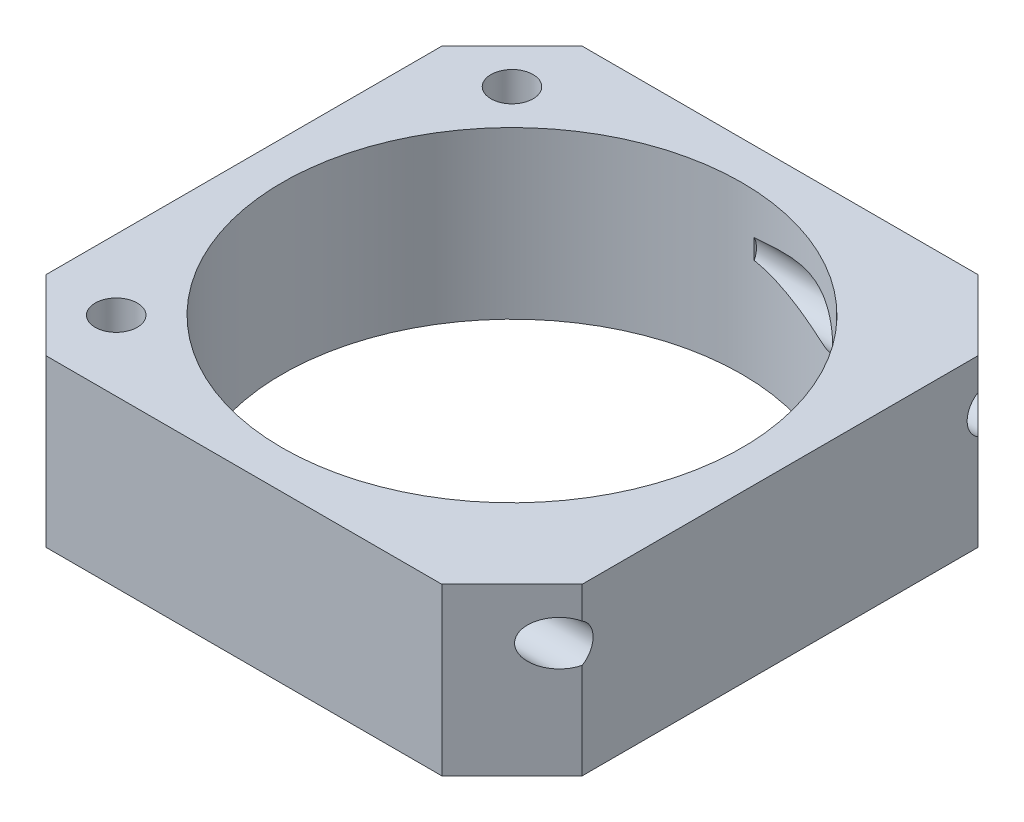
ISO-10303-21;
HEADER;
FILE_DESCRIPTION(('STEP AP214'),'2;1');
FILE_NAME('part.step','',(''),(''),'','','');
FILE_SCHEMA(('AUTOMOTIVE_DESIGN { 1 0 10303 214 1 1 1 1 }'));
ENDSEC;
DATA;
#1=APPLICATION_CONTEXT('core data for automotive mechanical design processes');
#2=APPLICATION_PROTOCOL_DEFINITION('international standard','automotive_design',2000,#1);
#3=PRODUCT_CONTEXT('',#1,'mechanical');
#4=PRODUCT('Part','Part','',(#3));
#5=PRODUCT_RELATED_PRODUCT_CATEGORY('part','',(#4));
#6=PRODUCT_DEFINITION_FORMATION('','',#4);
#7=PRODUCT_DEFINITION_CONTEXT('part definition',#1,'design');
#8=PRODUCT_DEFINITION('design','',#6,#7);
#9=PRODUCT_DEFINITION_SHAPE('','',#8);
#10=(LENGTH_UNIT() NAMED_UNIT(*) SI_UNIT(.MILLI.,.METRE.));
#11=(NAMED_UNIT(*) PLANE_ANGLE_UNIT() SI_UNIT($,.RADIAN.));
#12=(NAMED_UNIT(*) SI_UNIT($,.STERADIAN.) SOLID_ANGLE_UNIT());
#13=UNCERTAINTY_MEASURE_WITH_UNIT(LENGTH_MEASURE(1.E-05),#10,'distance_accuracy_value','');
#14=(GEOMETRIC_REPRESENTATION_CONTEXT(3) GLOBAL_UNCERTAINTY_ASSIGNED_CONTEXT((#13)) GLOBAL_UNIT_ASSIGNED_CONTEXT((#10,
#11,#12)) REPRESENTATION_CONTEXT('',''));
#15=CARTESIAN_POINT('',(0.,0.,0.));
#16=DIRECTION('',(0.,0.,1.));
#17=DIRECTION('',(1.,0.,0.));
#18=AXIS2_PLACEMENT_3D('',#15,#16,#17);
#19=CARTESIAN_POINT('',(0.,13.,0.));
#20=DIRECTION('',(0.,-1.,0.));
#21=DIRECTION('',(0.,0.,-1.));
#22=AXIS2_PLACEMENT_3D('',#19,#20,#21);
#23=PLANE('',#22);
#24=DIRECTION('',(1.,0.,0.));
#25=VECTOR('',#24,1.);
#26=CARTESIAN_POINT('',(0.,13.,0.));
#27=LINE('',#26,#25);
#28=CARTESIAN_POINT('',(5.5,13.,0.));
#29=VERTEX_POINT('',#28);
#30=CARTESIAN_POINT('',(36.5,13.,0.));
#31=VERTEX_POINT('',#30);
#32=EDGE_CURVE('E271',#29,#31,#27,.T.);
#33=ORIENTED_EDGE('',*,*,#32,.T.);
#34=DIRECTION('',(-0.707106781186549,0.,0.707106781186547));
#35=VECTOR('',#34,1.);
#36=CARTESIAN_POINT('',(42.,13.,-5.5));
#37=LINE('',#36,#35);
#38=CARTESIAN_POINT('',(42.,13.,-5.5));
#39=VERTEX_POINT('',#38);
#40=EDGE_CURVE('E163',#31,#39,#37,.F.);
#41=ORIENTED_EDGE('',*,*,#40,.T.);
#42=DIRECTION('',(0.,0.,-1.));
#43=VECTOR('',#42,1.);
#44=CARTESIAN_POINT('',(42.,13.,0.));
#45=LINE('',#44,#43);
#46=CARTESIAN_POINT('',(42.,13.,-36.5));
#47=VERTEX_POINT('',#46);
#48=EDGE_CURVE('E277',#39,#47,#45,.T.);
#49=ORIENTED_EDGE('',*,*,#48,.T.);
#50=DIRECTION('',(0.707106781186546,0.,0.707106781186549));
#51=VECTOR('',#50,1.);
#52=CARTESIAN_POINT('',(36.5,13.,-42.));
#53=LINE('',#52,#51);
#54=CARTESIAN_POINT('',(36.5,13.,-42.));
#55=VERTEX_POINT('',#54);
#56=EDGE_CURVE('E161',#47,#55,#53,.F.);
#57=ORIENTED_EDGE('',*,*,#56,.T.);
#58=DIRECTION('',(-1.,0.,0.));
#59=VECTOR('',#58,1.);
#60=CARTESIAN_POINT('',(0.,13.,-42.));
#61=LINE('',#60,#59);
#62=CARTESIAN_POINT('',(5.50000000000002,13.,-42.));
#63=VERTEX_POINT('',#62);
#64=EDGE_CURVE('E280',#55,#63,#61,.T.);
#65=ORIENTED_EDGE('',*,*,#64,.T.);
#66=DIRECTION('',(0.707106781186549,0.,-0.707106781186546));
#67=VECTOR('',#66,1.);
#68=CARTESIAN_POINT('',(0.,13.,-36.5));
#69=LINE('',#68,#67);
#70=CARTESIAN_POINT('',(0.,13.,-36.5));
#71=VERTEX_POINT('',#70);
#72=EDGE_CURVE('E157',#63,#71,#69,.F.);
#73=ORIENTED_EDGE('',*,*,#72,.T.);
#74=DIRECTION('',(0.,0.,1.));
#75=VECTOR('',#74,1.);
#76=CARTESIAN_POINT('',(0.,13.,0.));
#77=LINE('',#76,#75);
#78=CARTESIAN_POINT('',(0.,13.,-5.50000000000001));
#79=VERTEX_POINT('',#78);
#80=EDGE_CURVE('E274',#71,#79,#77,.T.);
#81=ORIENTED_EDGE('',*,*,#80,.T.);
#82=DIRECTION('',(-0.707106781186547,0.,-0.707106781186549));
#83=VECTOR('',#82,1.);
#84=CARTESIAN_POINT('',(5.5,13.,0.));
#85=LINE('',#84,#83);
#86=EDGE_CURVE('E159',#79,#29,#85,.F.);
#87=ORIENTED_EDGE('',*,*,#86,.T.);
#88=EDGE_LOOP('',(#33,#41,#49,#57,#65,#73,#81,#87));
#89=FACE_BOUND('',#88,.T.);
#90=CARTESIAN_POINT('',(5.5,13.,-36.5));
#91=DIRECTION('',(0.,1.,0.));
#92=DIRECTION('',(0.,0.,1.));
#93=AXIS2_PLACEMENT_3D('',#90,#91,#92);
#94=CIRCLE('',#93,1.65);
#95=CARTESIAN_POINT('',(5.5,13.,-38.15));
#96=VERTEX_POINT('',#95);
#97=EDGE_CURVE('E292',#96,#96,#94,.T.);
#98=ORIENTED_EDGE('',*,*,#97,.F.);
#99=EDGE_LOOP('',(#98));
#100=FACE_BOUND('',#99,.T.);
#101=CARTESIAN_POINT('',(21.0000000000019,13.,-21.0000000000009));
#102=DIRECTION('',(0.,1.,0.));
#103=DIRECTION('',(0.,0.,1.));
#104=AXIS2_PLACEMENT_3D('',#101,#102,#103);
#105=CIRCLE('',#104,18.);
#106=CARTESIAN_POINT('',(21.0000000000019,13.,-3.00000000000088));
#107=VERTEX_POINT('',#106);
#108=EDGE_CURVE('E318',#107,#107,#105,.T.);
#109=ORIENTED_EDGE('',*,*,#108,.F.);
#110=EDGE_LOOP('',(#109));
#111=FACE_BOUND('',#110,.T.);
#112=CARTESIAN_POINT('',(5.5,13.,-5.5));
#113=DIRECTION('',(0.,1.,0.));
#114=DIRECTION('',(0.,0.,1.));
#115=AXIS2_PLACEMENT_3D('',#112,#113,#114);
#116=CIRCLE('',#115,1.65);
#117=CARTESIAN_POINT('',(5.5,13.,-7.15));
#118=VERTEX_POINT('',#117);
#119=EDGE_CURVE('E210',#118,#118,#116,.T.);
#120=ORIENTED_EDGE('',*,*,#119,.F.);
#121=EDGE_LOOP('',(#120));
#122=FACE_BOUND('',#121,.T.);
#123=ADVANCED_FACE('F34',(#89,#100,#111,#122),#23,.F.);
#124=CARTESIAN_POINT('',(0.,0.,0.));
#125=DIRECTION('',(0.,-1.,0.));
#126=DIRECTION('',(0.,0.,-1.));
#127=AXIS2_PLACEMENT_3D('',#124,#125,#126);
#128=PLANE('',#127);
#129=CARTESIAN_POINT('',(21.0000000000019,0.,-21.0000000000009));
#130=DIRECTION('',(0.,1.,0.));
#131=DIRECTION('',(0.,0.,1.));
#132=AXIS2_PLACEMENT_3D('',#129,#130,#131);
#133=CIRCLE('',#132,18.);
#134=CARTESIAN_POINT('',(21.0000000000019,0.,-3.00000000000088));
#135=VERTEX_POINT('',#134);
#136=EDGE_CURVE('E316',#135,#135,#133,.T.);
#137=ORIENTED_EDGE('',*,*,#136,.T.);
#138=EDGE_LOOP('',(#137));
#139=FACE_BOUND('',#138,.T.);
#140=DIRECTION('',(0.,0.,-1.));
#141=VECTOR('',#140,1.);
#142=CARTESIAN_POINT('',(42.,0.,0.));
#143=LINE('',#142,#141);
#144=CARTESIAN_POINT('',(42.,0.,-5.5));
#145=VERTEX_POINT('',#144);
#146=CARTESIAN_POINT('',(42.,0.,-36.5));
#147=VERTEX_POINT('',#146);
#148=EDGE_CURVE('E294',#145,#147,#143,.T.);
#149=ORIENTED_EDGE('',*,*,#148,.F.);
#150=DIRECTION('',(0.707106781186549,0.,-0.707106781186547));
#151=VECTOR('',#150,1.);
#152=CARTESIAN_POINT('',(18.2499999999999,0.,18.25));
#153=LINE('',#152,#151);
#154=CARTESIAN_POINT('',(36.5,0.,0.));
#155=VERTEX_POINT('',#154);
#156=EDGE_CURVE('E136',#145,#155,#153,.F.);
#157=ORIENTED_EDGE('',*,*,#156,.T.);
#158=DIRECTION('',(1.,0.,0.));
#159=VECTOR('',#158,1.);
#160=CARTESIAN_POINT('',(0.,0.,0.));
#161=LINE('',#160,#159);
#162=CARTESIAN_POINT('',(5.5,0.,0.));
#163=VERTEX_POINT('',#162);
#164=EDGE_CURVE('E291',#163,#155,#161,.T.);
#165=ORIENTED_EDGE('',*,*,#164,.F.);
#166=DIRECTION('',(0.707106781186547,0.,0.707106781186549));
#167=VECTOR('',#166,1.);
#168=CARTESIAN_POINT('',(2.75000000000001,0.,-2.75));
#169=LINE('',#168,#167);
#170=CARTESIAN_POINT('',(0.,0.,-5.50000000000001));
#171=VERTEX_POINT('',#170);
#172=EDGE_CURVE('E147',#163,#171,#169,.F.);
#173=ORIENTED_EDGE('',*,*,#172,.T.);
#174=DIRECTION('',(0.,0.,1.));
#175=VECTOR('',#174,1.);
#176=CARTESIAN_POINT('',(0.,0.,0.));
#177=LINE('',#176,#175);
#178=CARTESIAN_POINT('',(0.,0.,-36.5));
#179=VERTEX_POINT('',#178);
#180=EDGE_CURVE('E288',#179,#171,#177,.T.);
#181=ORIENTED_EDGE('',*,*,#180,.F.);
#182=DIRECTION('',(-0.707106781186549,0.,0.707106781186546));
#183=VECTOR('',#182,1.);
#184=CARTESIAN_POINT('',(-18.25,0.,-18.2500000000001));
#185=LINE('',#184,#183);
#186=CARTESIAN_POINT('',(5.50000000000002,0.,-42.));
#187=VERTEX_POINT('',#186);
#188=EDGE_CURVE('E140',#179,#187,#185,.F.);
#189=ORIENTED_EDGE('',*,*,#188,.T.);
#190=DIRECTION('',(-1.,0.,0.));
#191=VECTOR('',#190,1.);
#192=CARTESIAN_POINT('',(0.,0.,-42.));
#193=LINE('',#192,#191);
#194=CARTESIAN_POINT('',(36.5,0.,-42.));
#195=VERTEX_POINT('',#194);
#196=EDGE_CURVE('E282',#195,#187,#193,.T.);
#197=ORIENTED_EDGE('',*,*,#196,.F.);
#198=DIRECTION('',(-0.707106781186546,0.,-0.707106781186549));
#199=VECTOR('',#198,1.);
#200=CARTESIAN_POINT('',(39.2500000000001,0.,-39.2499999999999));
#201=LINE('',#200,#199);
#202=EDGE_CURVE('E149',#195,#147,#201,.F.);
#203=ORIENTED_EDGE('',*,*,#202,.T.);
#204=EDGE_LOOP('',(#149,#157,#165,#173,#181,#189,#197,#203));
#205=FACE_BOUND('',#204,.T.);
#206=CARTESIAN_POINT('',(5.5,0.,-36.5));
#207=DIRECTION('',(0.,1.,0.));
#208=DIRECTION('',(0.,0.,1.));
#209=AXIS2_PLACEMENT_3D('',#206,#207,#208);
#210=CIRCLE('',#209,1.65);
#211=CARTESIAN_POINT('',(5.5,0.,-38.15));
#212=VERTEX_POINT('',#211);
#213=EDGE_CURVE('E313',#212,#212,#210,.T.);
#214=ORIENTED_EDGE('',*,*,#213,.T.);
#215=EDGE_LOOP('',(#214));
#216=FACE_BOUND('',#215,.T.);
#217=CARTESIAN_POINT('',(5.5,0.,-5.5));
#218=DIRECTION('',(0.,1.,0.));
#219=DIRECTION('',(0.,0.,1.));
#220=AXIS2_PLACEMENT_3D('',#217,#218,#219);
#221=CIRCLE('',#220,1.65);
#222=CARTESIAN_POINT('',(5.5,0.,-7.15));
#223=VERTEX_POINT('',#222);
#224=EDGE_CURVE('E193',#223,#223,#221,.T.);
#225=ORIENTED_EDGE('',*,*,#224,.T.);
#226=EDGE_LOOP('',(#225));
#227=FACE_BOUND('',#226,.T.);
#228=ADVANCED_FACE('F232',(#139,#205,#216,#227),#128,.T.);
#229=CARTESIAN_POINT('',(0.,13.,0.));
#230=DIRECTION('',(1.,0.,0.));
#231=DIRECTION('',(0.,0.,-1.));
#232=AXIS2_PLACEMENT_3D('',#229,#230,#231);
#233=PLANE('',#232);
#234=ORIENTED_EDGE('',*,*,#180,.T.);
#235=DIRECTION('',(0.,1.,0.));
#236=VECTOR('',#235,1.);
#237=CARTESIAN_POINT('',(0.,13.,-5.50000000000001));
#238=LINE('',#237,#236);
#239=EDGE_CURVE('E173',#171,#79,#238,.T.);
#240=ORIENTED_EDGE('',*,*,#239,.T.);
#241=ORIENTED_EDGE('',*,*,#80,.F.);
#242=DIRECTION('',(0.,-1.,0.));
#243=VECTOR('',#242,1.);
#244=CARTESIAN_POINT('',(0.,13.,-36.5));
#245=LINE('',#244,#243);
#246=EDGE_CURVE('E170',#71,#179,#245,.T.);
#247=ORIENTED_EDGE('',*,*,#246,.T.);
#248=EDGE_LOOP('',(#234,#240,#241,#247));
#249=FACE_BOUND('',#248,.T.);
#250=ADVANCED_FACE('F238',(#249),#233,.F.);
#251=CARTESIAN_POINT('',(0.,13.,0.));
#252=DIRECTION('',(0.,0.,-1.));
#253=DIRECTION('',(-1.,0.,0.));
#254=AXIS2_PLACEMENT_3D('',#251,#252,#253);
#255=PLANE('',#254);
#256=ORIENTED_EDGE('',*,*,#164,.T.);
#257=DIRECTION('',(0.,1.,0.));
#258=VECTOR('',#257,1.);
#259=CARTESIAN_POINT('',(36.5,13.,0.));
#260=LINE('',#259,#258);
#261=EDGE_CURVE('E155',#155,#31,#260,.T.);
#262=ORIENTED_EDGE('',*,*,#261,.T.);
#263=ORIENTED_EDGE('',*,*,#32,.F.);
#264=DIRECTION('',(0.,-1.,0.));
#265=VECTOR('',#264,1.);
#266=CARTESIAN_POINT('',(5.5,13.,0.));
#267=LINE('',#266,#265);
#268=EDGE_CURVE('E152',#29,#163,#267,.T.);
#269=ORIENTED_EDGE('',*,*,#268,.T.);
#270=EDGE_LOOP('',(#256,#262,#263,#269));
#271=FACE_BOUND('',#270,.T.);
#272=ADVANCED_FACE('F250',(#271),#255,.F.);
#273=CARTESIAN_POINT('',(42.,13.,0.));
#274=DIRECTION('',(-1.,0.,0.));
#275=DIRECTION('',(0.,0.,1.));
#276=AXIS2_PLACEMENT_3D('',#273,#274,#275);
#277=PLANE('',#276);
#278=DIRECTION('',(0.,-1.,0.));
#279=VECTOR('',#278,1.);
#280=CARTESIAN_POINT('',(42.,13.,-5.5));
#281=LINE('',#280,#279);
#282=CARTESIAN_POINT('',(42.,10.5008331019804,-5.5));
#283=VERTEX_POINT('',#282);
#284=EDGE_CURVE('E132',#39,#283,#281,.T.);
#285=ORIENTED_EDGE('',*,*,#284,.T.);
#286=CARTESIAN_POINT('',(42.,9.,-4.6));
#287=DIRECTION('',(1.,0.,0.));
#288=DIRECTION('',(0.,0.,-1.));
#289=AXIS2_PLACEMENT_3D('',#286,#287,#288);
#290=CIRCLE('',#289,1.75);
#291=CARTESIAN_POINT('',(42.,7.49916689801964,-5.5));
#292=VERTEX_POINT('',#291);
#293=EDGE_CURVE('E55',#292,#283,#290,.T.);
#294=ORIENTED_EDGE('',*,*,#293,.F.);
#295=EDGE_CURVE('E129',#292,#145,#281,.T.);
#296=ORIENTED_EDGE('',*,*,#295,.T.);
#297=ORIENTED_EDGE('',*,*,#148,.T.);
#298=DIRECTION('',(0.,1.,0.));
#299=VECTOR('',#298,1.);
#300=CARTESIAN_POINT('',(42.,13.,-36.5));
#301=LINE('',#300,#299);
#302=CARTESIAN_POINT('',(42.,7.49916689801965,-36.5));
#303=VERTEX_POINT('',#302);
#304=EDGE_CURVE('E138',#147,#303,#301,.T.);
#305=ORIENTED_EDGE('',*,*,#304,.T.);
#306=CARTESIAN_POINT('',(42.,9.,-37.4));
#307=DIRECTION('',(1.,0.,0.));
#308=DIRECTION('',(0.,0.,-1.));
#309=AXIS2_PLACEMENT_3D('',#306,#307,#308);
#310=CIRCLE('',#309,1.75);
#311=CARTESIAN_POINT('',(42.,10.5008331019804,-36.5));
#312=VERTEX_POINT('',#311);
#313=EDGE_CURVE('E191',#312,#303,#310,.T.);
#314=ORIENTED_EDGE('',*,*,#313,.F.);
#315=EDGE_CURVE('E142',#312,#47,#301,.T.);
#316=ORIENTED_EDGE('',*,*,#315,.T.);
#317=ORIENTED_EDGE('',*,*,#48,.F.);
#318=EDGE_LOOP('',(#285,#294,#296,#297,#305,#314,#316,#317));
#319=FACE_BOUND('',#318,.T.);
#320=ADVANCED_FACE('F127',(#319),#277,.F.);
#321=CARTESIAN_POINT('',(0.,13.,-42.));
#322=DIRECTION('',(0.,0.,1.));
#323=DIRECTION('',(1.,0.,0.));
#324=AXIS2_PLACEMENT_3D('',#321,#322,#323);
#325=PLANE('',#324);
#326=ORIENTED_EDGE('',*,*,#64,.F.);
#327=DIRECTION('',(0.,-1.,0.));
#328=VECTOR('',#327,1.);
#329=CARTESIAN_POINT('',(36.5,13.,-42.));
#330=LINE('',#329,#328);
#331=EDGE_CURVE('E167',#55,#195,#330,.T.);
#332=ORIENTED_EDGE('',*,*,#331,.T.);
#333=ORIENTED_EDGE('',*,*,#196,.T.);
#334=DIRECTION('',(0.,1.,0.));
#335=VECTOR('',#334,1.);
#336=CARTESIAN_POINT('',(5.50000000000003,13.,-42.));
#337=LINE('',#336,#335);
#338=EDGE_CURVE('E165',#187,#63,#337,.T.);
#339=ORIENTED_EDGE('',*,*,#338,.T.);
#340=EDGE_LOOP('',(#326,#332,#333,#339));
#341=FACE_BOUND('',#340,.T.);
#342=ADVANCED_FACE('F244',(#341),#325,.F.);
#343=CARTESIAN_POINT('',(5.5,13.,-36.5));
#344=DIRECTION('',(0.,-1.,0.));
#345=DIRECTION('',(0.,0.,-1.));
#346=AXIS2_PLACEMENT_3D('',#343,#344,#345);
#347=CYLINDRICAL_SURFACE('',#346,1.65);
#348=CARTESIAN_POINT('',(5.5,13.,-38.15));
#349=CARTESIAN_POINT('',(5.5,12.8645833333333,-38.15));
#350=CARTESIAN_POINT('',(5.5,12.7291666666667,-38.15));
#351=CARTESIAN_POINT('',(5.5,12.4583333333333,-38.15));
#352=CARTESIAN_POINT('',(5.5,12.3229166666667,-38.15));
#353=CARTESIAN_POINT('',(5.5,12.0520833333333,-38.15));
#354=CARTESIAN_POINT('',(5.5,11.9166666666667,-38.15));
#355=CARTESIAN_POINT('',(5.5,11.6458333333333,-38.15));
#356=CARTESIAN_POINT('',(5.5,11.5104166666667,-38.15));
#357=CARTESIAN_POINT('',(5.5,11.2395833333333,-38.15));
#358=CARTESIAN_POINT('',(5.5,11.1041666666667,-38.15));
#359=CARTESIAN_POINT('',(5.5,10.8333333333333,-38.15));
#360=CARTESIAN_POINT('',(5.5,10.6979166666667,-38.15));
#361=CARTESIAN_POINT('',(5.5,10.4270833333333,-38.15));
#362=CARTESIAN_POINT('',(5.5,10.2916666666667,-38.15));
#363=CARTESIAN_POINT('',(5.5,10.0208333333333,-38.15));
#364=CARTESIAN_POINT('',(5.5,9.88541666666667,-38.15));
#365=CARTESIAN_POINT('',(5.5,9.61458333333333,-38.15));
#366=CARTESIAN_POINT('',(5.5,9.47916666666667,-38.15));
#367=CARTESIAN_POINT('',(5.5,9.20833333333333,-38.15));
#368=CARTESIAN_POINT('',(5.5,9.07291666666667,-38.15));
#369=CARTESIAN_POINT('',(5.5,8.80208333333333,-38.15));
#370=CARTESIAN_POINT('',(5.5,8.66666666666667,-38.15));
#371=CARTESIAN_POINT('',(5.5,8.39583333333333,-38.15));
#372=CARTESIAN_POINT('',(5.5,8.26041666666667,-38.15));
#373=CARTESIAN_POINT('',(5.5,7.98958333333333,-38.15));
#374=CARTESIAN_POINT('',(5.5,7.85416666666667,-38.15));
#375=CARTESIAN_POINT('',(5.5,7.58333333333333,-38.15));
#376=CARTESIAN_POINT('',(5.5,7.44791666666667,-38.15));
#377=CARTESIAN_POINT('',(5.5,7.17708333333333,-38.15));
#378=CARTESIAN_POINT('',(5.5,7.04166666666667,-38.15));
#379=CARTESIAN_POINT('',(5.5,6.77083333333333,-38.15));
#380=CARTESIAN_POINT('',(5.5,6.63541666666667,-38.15));
#381=CARTESIAN_POINT('',(5.5,6.36458333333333,-38.15));
#382=CARTESIAN_POINT('',(5.5,6.22916666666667,-38.15));
#383=CARTESIAN_POINT('',(5.5,5.95833333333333,-38.15));
#384=CARTESIAN_POINT('',(5.5,5.82291666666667,-38.15));
#385=CARTESIAN_POINT('',(5.5,5.55208333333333,-38.15));
#386=CARTESIAN_POINT('',(5.5,5.41666666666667,-38.15));
#387=CARTESIAN_POINT('',(5.5,5.14583333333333,-38.15));
#388=CARTESIAN_POINT('',(5.5,5.01041666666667,-38.15));
#389=CARTESIAN_POINT('',(5.5,4.73958333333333,-38.15));
#390=CARTESIAN_POINT('',(5.5,4.60416666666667,-38.15));
#391=CARTESIAN_POINT('',(5.5,4.33333333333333,-38.15));
#392=CARTESIAN_POINT('',(5.5,4.19791666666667,-38.15));
#393=CARTESIAN_POINT('',(5.5,3.92708333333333,-38.15));
#394=CARTESIAN_POINT('',(5.5,3.79166666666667,-38.15));
#395=CARTESIAN_POINT('',(5.5,3.52083333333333,-38.15));
#396=CARTESIAN_POINT('',(5.5,3.38541666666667,-38.15));
#397=CARTESIAN_POINT('',(5.5,3.11458333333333,-38.15));
#398=CARTESIAN_POINT('',(5.5,2.97916666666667,-38.15));
#399=CARTESIAN_POINT('',(5.5,2.70833333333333,-38.15));
#400=CARTESIAN_POINT('',(5.5,2.57291666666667,-38.15));
#401=CARTESIAN_POINT('',(5.5,2.30208333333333,-38.15));
#402=CARTESIAN_POINT('',(5.5,2.16666666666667,-38.15));
#403=CARTESIAN_POINT('',(5.5,1.89583333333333,-38.15));
#404=CARTESIAN_POINT('',(5.5,1.76041666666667,-38.15));
#405=CARTESIAN_POINT('',(5.5,1.48958333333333,-38.15));
#406=CARTESIAN_POINT('',(5.5,1.35416666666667,-38.15));
#407=CARTESIAN_POINT('',(5.5,1.08333333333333,-38.15));
#408=CARTESIAN_POINT('',(5.5,0.947916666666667,-38.15));
#409=CARTESIAN_POINT('',(5.5,0.677083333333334,-38.15));
#410=CARTESIAN_POINT('',(5.5,0.541666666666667,-38.15));
#411=CARTESIAN_POINT('',(5.5,0.270833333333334,-38.15));
#412=CARTESIAN_POINT('',(5.5,0.135416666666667,-38.15));
#413=CARTESIAN_POINT('',(5.5,0.,-38.15));
#414=B_SPLINE_CURVE_WITH_KNOTS('',3,(#348,#349,#350,#351,#352,#353,#354,#355,#356,#357,#358,
#359,#360,#361,#362,#363,#364,#365,#366,#367,#368,#369,#370,#371,#372,#373,#374,#375,#376,#377,
#378,#379,#380,#381,#382,#383,#384,#385,#386,#387,#388,#389,#390,#391,#392,#393,#394,#395,#396,
#397,#398,#399,#400,#401,#402,#403,#404,#405,#406,#407,#408,#409,#410,#411,#412,#413),
.UNSPECIFIED.,.F.,.F.,(4,2,2,2,2,2,2,2,2,2,2,2,2,2,2,2,2,2,2,2,2,2,2,2,2,2,2,2,2,2,2,2,4),(0.,
0.406249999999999,0.812499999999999,1.21875,1.625,2.03125,2.4375,2.84375,3.25,3.65625,4.0625,
4.46875,4.875,5.28125,5.6875,6.09375,6.5,6.90625,7.3125,7.71875,8.125,8.53125,8.9375,9.34375,
9.75,10.15625,10.5625,10.96875,11.375,11.78125,12.1875,12.59375,13.),.UNSPECIFIED.);
#415=EDGE_CURVE('BSEAM227',#96,#212,#414,.T.);
#416=ORIENTED_EDGE('',*,*,#97,.T.);
#417=ORIENTED_EDGE('',*,*,#213,.F.);
#418=ORIENTED_EDGE('',*,*,#415,.T.);
#419=ORIENTED_EDGE('',*,*,#415,.F.);
#420=EDGE_LOOP('',(#416,#418,#417,#419));
#421=FACE_BOUND('',#420,.T.);
#422=ADVANCED_FACE('F227',(#421),#347,.F.);
#423=CARTESIAN_POINT('',(21.0000000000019,13.,-21.0000000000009));
#424=DIRECTION('',(0.,-1.,0.));
#425=DIRECTION('',(0.,0.,-1.));
#426=AXIS2_PLACEMENT_3D('',#423,#424,#425);
#427=CYLINDRICAL_SURFACE('',#426,18.);
#428=CARTESIAN_POINT('',(22.,9.76856020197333,-3.02779924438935));
#429=CARTESIAN_POINT('',(22.1455474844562,9.78515531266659,-3.03589946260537));
#430=CARTESIAN_POINT('',(22.2906203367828,9.8046115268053,-3.04574334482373));
#431=CARTESIAN_POINT('',(22.5797961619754,9.84778433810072,-3.06887371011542));
#432=CARTESIAN_POINT('',(22.7238995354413,9.87149904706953,-3.08215866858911));
#433=CARTESIAN_POINT('',(23.0111713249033,9.92173148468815,-3.11212606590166));
#434=CARTESIAN_POINT('',(23.1543401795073,9.94824778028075,-3.1288067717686));
#435=CARTESIAN_POINT('',(23.4399306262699,10.0029724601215,-3.16555395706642));
#436=CARTESIAN_POINT('',(23.5823521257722,10.0311810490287,-3.1856208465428));
#437=CARTESIAN_POINT('',(24.0105909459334,10.1173300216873,-3.25119229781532));
#438=CARTESIAN_POINT('',(24.2954011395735,10.1764195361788,-3.30186076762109));
#439=CARTESIAN_POINT('',(24.8627323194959,10.2921394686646,-3.41696683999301));
#440=CARTESIAN_POINT('',(25.1452532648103,10.3487698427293,-3.4814046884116));
#441=CARTESIAN_POINT('',(25.7079929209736,10.4554119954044,-3.62418269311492));
#442=CARTESIAN_POINT('',(25.9882121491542,10.5054253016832,-3.70251963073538));
#443=CARTESIAN_POINT('',(26.5461892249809,10.5948867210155,-3.87326813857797));
#444=CARTESIAN_POINT('',(26.823946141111,10.6343309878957,-3.96568481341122));
#445=CARTESIAN_POINT('',(27.3762277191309,10.6982007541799,-4.16462729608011));
#446=CARTESIAN_POINT('',(27.6507527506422,10.7226279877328,-4.27115147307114));
#447=CARTESIAN_POINT('',(28.0589158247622,10.7437117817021,-4.44121268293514));
#448=CARTESIAN_POINT('',(28.1943215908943,10.7481479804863,-4.49959108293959));
#449=CARTESIAN_POINT('',(28.4636986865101,10.7509208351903,-4.619678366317));
#450=CARTESIAN_POINT('',(28.5976702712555,10.7492585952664,-4.68138664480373));
#451=CARTESIAN_POINT('',(28.8848662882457,10.737930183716,-4.81797338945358));
#452=CARTESIAN_POINT('',(29.0377916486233,10.7270420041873,-4.89339320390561));
#453=CARTESIAN_POINT('',(29.3405697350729,10.693516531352,-5.04807784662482));
#454=CARTESIAN_POINT('',(29.4904200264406,10.6708702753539,-5.12734556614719));
#455=CARTESIAN_POINT('',(29.7848065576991,10.6112048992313,-5.28837751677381));
#456=CARTESIAN_POINT('',(29.9293696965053,10.574274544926,-5.37012351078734));
#457=CARTESIAN_POINT('',(30.1411034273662,10.5053555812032,-5.49364914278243));
#458=CARTESIAN_POINT('',(30.210775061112,10.4801545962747,-5.53494159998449));
#459=CARTESIAN_POINT('',(30.3480413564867,10.4246474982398,-5.61752473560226));
#460=CARTESIAN_POINT('',(30.4156361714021,10.3943417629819,-5.65881541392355));
#461=CARTESIAN_POINT('',(30.5845727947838,10.3097466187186,-5.76351600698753));
#462=CARTESIAN_POINT('',(30.6841532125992,10.2514049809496,-5.82667288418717));
#463=CARTESIAN_POINT('',(30.8263083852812,10.1513802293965,-5.91865787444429));
#464=CARTESIAN_POINT('',(30.8724604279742,10.1159830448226,-5.94884054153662));
#465=CARTESIAN_POINT('',(30.9617903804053,10.0405988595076,-6.00781585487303));
#466=CARTESIAN_POINT('',(31.0049700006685,10.000614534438,-6.03660929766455));
#467=CARTESIAN_POINT('',(31.0967191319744,9.90629201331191,-6.09832395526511));
#468=CARTESIAN_POINT('',(31.144382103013,9.85073178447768,-6.13075815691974));
#469=CARTESIAN_POINT('',(31.2322276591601,9.73172753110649,-6.19107184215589));
#470=CARTESIAN_POINT('',(31.2724185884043,9.66829243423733,-6.21895640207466));
#471=CARTESIAN_POINT('',(31.3363225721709,9.54622083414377,-6.26359372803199));
#472=CARTESIAN_POINT('',(31.361709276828,9.48887682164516,-6.28145191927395));
#473=CARTESIAN_POINT('',(31.4043637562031,9.36983446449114,-6.31157253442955));
#474=CARTESIAN_POINT('',(31.4216380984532,9.30813968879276,-6.32383948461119));
#475=CARTESIAN_POINT('',(31.4468232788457,9.18140274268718,-6.3417554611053));
#476=CARTESIAN_POINT('',(31.4546642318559,9.11633926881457,-6.3473550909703));
#477=CARTESIAN_POINT('',(31.45999630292,8.98557740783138,-6.35116073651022));
#478=CARTESIAN_POINT('',(31.4574912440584,8.91987926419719,-6.3493694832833));
#479=CARTESIAN_POINT('',(31.4432828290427,8.79787546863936,-6.33923943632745));
#480=CARTESIAN_POINT('',(31.4326860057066,8.74136782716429,-6.33168840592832));
#481=CARTESIAN_POINT('',(31.4043805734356,8.63111208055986,-6.31159760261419));
#482=CARTESIAN_POINT('',(31.386669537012,8.57736492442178,-6.29905612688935));
#483=CARTESIAN_POINT('',(31.3378659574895,8.45534910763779,-6.26467880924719));
#484=CARTESIAN_POINT('',(31.3042598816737,8.38857280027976,-6.24112647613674));
#485=CARTESIAN_POINT('',(31.2284562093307,8.26251051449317,-6.18849019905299));
#486=CARTESIAN_POINT('',(31.1862410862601,8.20324022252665,-6.15939497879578));
#487=CARTESIAN_POINT('',(31.0730368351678,8.06480921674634,-6.08220538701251));
#488=CARTESIAN_POINT('',(30.9981037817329,7.99019191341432,-6.03180190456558));
#489=CARTESIAN_POINT('',(30.8388823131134,7.85553665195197,-5.92666046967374));
#490=CARTESIAN_POINT('',(30.7545744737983,7.79552981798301,-5.87191358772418));
#491=CARTESIAN_POINT('',(30.5915312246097,7.6952039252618,-5.76810642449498));
#492=CARTESIAN_POINT('',(30.5135891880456,7.65331880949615,-5.7192810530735));
#493=CARTESIAN_POINT('',(30.3541665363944,7.57748293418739,-5.62117240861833));
#494=CARTESIAN_POINT('',(30.2726833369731,7.54353808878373,-5.57188882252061));
#495=CARTESIAN_POINT('',(30.1069419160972,7.48247050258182,-5.47347702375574));
#496=CARTESIAN_POINT('',(30.0226793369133,7.45535911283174,-5.42434920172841));
#497=CARTESIAN_POINT('',(29.852068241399,7.4071145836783,-5.32675643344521));
#498=CARTESIAN_POINT('',(29.7657189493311,7.38598370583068,-5.2782917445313));
#499=CARTESIAN_POINT('',(29.5097864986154,7.33158965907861,-5.13744775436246));
#500=CARTESIAN_POINT('',(29.3379293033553,7.30547725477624,-5.04641370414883));
#501=CARTESIAN_POINT('',(28.9900148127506,7.26849256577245,-4.86934965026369));
#502=CARTESIAN_POINT('',(28.8139537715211,7.25763443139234,-4.78332436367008));
#503=CARTESIAN_POINT('',(28.4585829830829,7.24809364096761,-4.61683482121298));
#504=CARTESIAN_POINT('',(28.2792683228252,7.24943125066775,-4.53638004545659));
#505=CARTESIAN_POINT('',(27.9184833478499,7.26195407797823,-4.38154251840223));
#506=CARTESIAN_POINT('',(27.7370137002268,7.2731363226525,-4.30715794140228));
#507=CARTESIAN_POINT('',(27.3669743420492,7.30391639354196,-4.16247476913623));
#508=CARTESIAN_POINT('',(27.1783528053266,7.32375210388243,-4.09236074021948));
#509=CARTESIAN_POINT('',(26.799601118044,7.37019262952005,-3.95872735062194));
#510=CARTESIAN_POINT('',(26.6094706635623,7.39679884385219,-3.89520935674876));
#511=CARTESIAN_POINT('',(26.0368433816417,7.48466200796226,-3.7144410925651));
#512=CARTESIAN_POINT('',(25.6524005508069,7.55393482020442,-3.60708961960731));
#513=CARTESIAN_POINT('',(25.072838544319,7.66602604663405,-3.46570411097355));
#514=CARTESIAN_POINT('',(24.8791914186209,7.70474837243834,-3.42185326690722));
#515=CARTESIAN_POINT('',(24.4908250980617,7.78358018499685,-3.3406261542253));
#516=CARTESIAN_POINT('',(24.296106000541,7.8236895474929,-3.30324930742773));
#517=CARTESIAN_POINT('',(23.9056543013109,7.90366824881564,-3.23496606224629));
#518=CARTESIAN_POINT('',(23.7099225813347,7.9435377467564,-3.20405477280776));
#519=CARTESIAN_POINT('',(23.3171251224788,8.02103133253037,-3.14866214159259));
#520=CARTESIAN_POINT('',(23.1200596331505,8.05865582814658,-3.1241796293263));
#521=CARTESIAN_POINT('',(22.8458165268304,8.10730599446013,-3.09472534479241));
#522=CARTESIAN_POINT('',(22.7693099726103,8.12048077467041,-3.08700286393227));
#523=CARTESIAN_POINT('',(22.6160494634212,8.14587053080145,-3.07252641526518));
#524=CARTESIAN_POINT('',(22.5392955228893,8.15808556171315,-3.06577239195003));
#525=CARTESIAN_POINT('',(22.3856059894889,8.18132933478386,-3.05324446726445));
#526=CARTESIAN_POINT('',(22.30867065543,8.19235925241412,-3.0474695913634));
#527=CARTESIAN_POINT('',(22.1545322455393,8.21301338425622,-3.03689827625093));
#528=CARTESIAN_POINT('',(22.077329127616,8.22263736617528,-3.03210199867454));
#529=CARTESIAN_POINT('',(22.,8.23143979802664,-3.02779924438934));
#530=B_SPLINE_CURVE_WITH_KNOTS('',3,(#428,#429,#430,#431,#432,#433,#434,#435,#436,#437,#438,
#439,#440,#441,#442,#443,#444,#445,#446,#447,#448,#449,#450,#451,#452,#453,#454,#455,#456,#457,
#458,#459,#460,#461,#462,#463,#464,#465,#466,#467,#468,#469,#470,#471,#472,#473,#474,#475,#476,
#477,#478,#479,#480,#481,#482,#483,#484,#485,#486,#487,#488,#489,#490,#491,#492,#493,#494,#495,
#496,#497,#498,#499,#500,#501,#502,#503,#504,#505,#506,#507,#508,#509,#510,#511,#512,#513,#514,
#515,#516,#517,#518,#519,#520,#521,#522,#523,#524,#525,#526,#527,#528,#529),.UNSPECIFIED.,.F.,
.F.,(4,2,2,2,2,2,2,2,2,2,2,2,2,2,2,2,2,2,2,2,2,2,2,2,2,2,2,2,2,2,2,2,2,2,2,2,2,2,2,2,2,2,2,2,2,
2,2,2,2,2,4),(0.,0.440031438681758,0.879868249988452,1.31948115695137,1.75914733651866,
2.64455421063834,3.52997689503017,4.41519480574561,5.30073441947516,6.18617175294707,
6.62859569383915,7.07093953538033,7.58310762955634,8.09566670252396,8.60509046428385,
8.85939013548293,9.11367099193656,9.50701829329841,9.70341118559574,9.89969009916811,
10.1391852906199,10.378411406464,10.5732634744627,10.7679575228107,10.9640852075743,
11.1601404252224,11.333336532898,11.5065917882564,11.7404177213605,11.9747245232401,
12.3242022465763,12.6744180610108,12.9771690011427,13.2801447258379,13.583620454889,
13.8872107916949,14.4748942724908,15.0631225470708,15.6523284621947,16.2413565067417,
16.8477119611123,17.4541928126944,18.6680888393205,19.2748927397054,19.8816424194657,
20.487931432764,21.0941099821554,21.3281479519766,21.5621725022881,21.7959627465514,
22.0297915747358),.UNSPECIFIED.);
#531=CARTESIAN_POINT('',(22.,9.76856020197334,-3.02779924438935));
#532=VERTEX_POINT('',#531);
#533=CARTESIAN_POINT('',(22.,8.23143979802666,-3.02779924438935));
#534=VERTEX_POINT('',#533);
#535=EDGE_CURVE('E195',#532,#534,#530,.T.);
#536=ORIENTED_EDGE('',*,*,#535,.F.);
#537=DIRECTION('',(0.,-1.,0.));
#538=VECTOR('',#537,1.);
#539=CARTESIAN_POINT('',(22.,13.,-3.02779924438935));
#540=LINE('',#539,#538);
#541=EDGE_CURVE('E11',#532,#534,#540,.T.);
#542=ORIENTED_EDGE('',*,*,#541,.T.);
#543=EDGE_LOOP('',(#536,#542));
#544=FACE_BOUND('',#543,.T.);
#545=CARTESIAN_POINT('',(22.,8.23143979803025,-38.9722007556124));
#546=CARTESIAN_POINT('',(22.1455474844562,8.2148446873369,-38.9641005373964));
#547=CARTESIAN_POINT('',(22.2906203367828,8.19538847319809,-38.954256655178));
#548=CARTESIAN_POINT('',(22.5797961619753,8.15221566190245,-38.9311262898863));
#549=CARTESIAN_POINT('',(22.7238995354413,8.12850095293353,-38.9178413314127));
#550=CARTESIAN_POINT('',(23.0111713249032,8.0782685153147,-38.8878739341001));
#551=CARTESIAN_POINT('',(23.1543401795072,8.05175221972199,-38.8711932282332));
#552=CARTESIAN_POINT('',(23.4399306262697,7.99702753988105,-38.8344460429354));
#553=CARTESIAN_POINT('',(23.582352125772,7.96881895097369,-38.814379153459));
#554=CARTESIAN_POINT('',(24.0105909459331,7.88266997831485,-38.7488077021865));
#555=CARTESIAN_POINT('',(24.2954011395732,7.82358046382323,-38.6981392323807));
#556=CARTESIAN_POINT('',(24.8627323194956,7.70786053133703,-38.5830331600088));
#557=CARTESIAN_POINT('',(25.1452532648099,7.65123015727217,-38.5185953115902));
#558=CARTESIAN_POINT('',(25.7079929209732,7.5445880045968,-38.3758173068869));
#559=CARTESIAN_POINT('',(25.9882121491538,7.49457469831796,-38.2974803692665));
#560=CARTESIAN_POINT('',(26.5461892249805,7.40511327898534,-38.1267318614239));
#561=CARTESIAN_POINT('',(26.8239461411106,7.36566901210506,-38.0343151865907));
#562=CARTESIAN_POINT('',(27.3762277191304,7.30179924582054,-37.8353727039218));
#563=CARTESIAN_POINT('',(27.6507527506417,7.27737201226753,-37.7288485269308));
#564=CARTESIAN_POINT('',(28.0589158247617,7.25628821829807,-37.5587873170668));
#565=CARTESIAN_POINT('',(28.1943215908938,7.25185201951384,-37.5004089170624));
#566=CARTESIAN_POINT('',(28.4636986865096,7.24907916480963,-37.380321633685));
#567=CARTESIAN_POINT('',(28.597670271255,7.25074140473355,-37.3186133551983));
#568=CARTESIAN_POINT('',(28.8848662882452,7.26206981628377,-37.1820266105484));
#569=CARTESIAN_POINT('',(29.0377916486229,7.27295799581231,-37.1066067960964));
#570=CARTESIAN_POINT('',(29.3405697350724,7.30648346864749,-36.9519221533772));
#571=CARTESIAN_POINT('',(29.4904200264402,7.32912972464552,-36.8726544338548));
#572=CARTESIAN_POINT('',(29.7848065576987,7.38879510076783,-36.7116224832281));
#573=CARTESIAN_POINT('',(29.929369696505,7.42572545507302,-36.6298764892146));
#574=CARTESIAN_POINT('',(30.1411034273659,7.49464441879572,-36.5063508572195));
#575=CARTESIAN_POINT('',(30.2107750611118,7.51984540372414,-36.4650584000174));
#576=CARTESIAN_POINT('',(30.3480413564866,7.5753525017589,-36.3824752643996));
#577=CARTESIAN_POINT('',(30.415636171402,7.60565823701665,-36.3411845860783));
#578=CARTESIAN_POINT('',(30.584572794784,7.69025338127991,-36.2364839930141));
#579=CARTESIAN_POINT('',(30.6841532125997,7.74859501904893,-36.1733271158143));
#580=CARTESIAN_POINT('',(30.8263083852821,7.84861977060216,-36.0813421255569));
#581=CARTESIAN_POINT('',(30.8724604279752,7.88401695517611,-36.0511594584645));
#582=CARTESIAN_POINT('',(30.9617903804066,7.9594011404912,-35.9921841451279));
#583=CARTESIAN_POINT('',(31.0049700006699,7.99938546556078,-35.9633907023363));
#584=CARTESIAN_POINT('',(31.096719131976,8.09370798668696,-35.9016760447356));
#585=CARTESIAN_POINT('',(31.1443821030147,8.14926821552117,-35.8692418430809));
#586=CARTESIAN_POINT('',(31.2322276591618,8.26827246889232,-35.8089281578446));
#587=CARTESIAN_POINT('',(31.2724185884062,8.33170756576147,-35.7810435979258));
#588=CARTESIAN_POINT('',(31.3363225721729,8.45377916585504,-35.7364062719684));
#589=CARTESIAN_POINT('',(31.36170927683,8.51112317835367,-35.7185480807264));
#590=CARTESIAN_POINT('',(31.4043637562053,8.63016553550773,-35.6884274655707));
#591=CARTESIAN_POINT('',(31.4216380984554,8.69186031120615,-35.676160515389));
#592=CARTESIAN_POINT('',(31.4468232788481,8.81859725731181,-35.6582445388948));
#593=CARTESIAN_POINT('',(31.4546642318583,8.88366073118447,-35.6526449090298));
#594=CARTESIAN_POINT('',(31.4599963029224,9.01442259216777,-35.6488392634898));
#595=CARTESIAN_POINT('',(31.4574912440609,9.08012073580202,-35.6506305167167));
#596=CARTESIAN_POINT('',(31.4432828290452,9.20212453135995,-35.6607605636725));
#597=CARTESIAN_POINT('',(31.4326860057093,9.25863217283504,-35.6683115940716));
#598=CARTESIAN_POINT('',(31.4043805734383,9.36888791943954,-35.6884023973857));
#599=CARTESIAN_POINT('',(31.3866695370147,9.42263507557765,-35.7009438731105));
#600=CARTESIAN_POINT('',(31.3378659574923,9.54465089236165,-35.7353211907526));
#601=CARTESIAN_POINT('',(31.3042598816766,9.61142719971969,-35.7588735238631));
#602=CARTESIAN_POINT('',(31.2284562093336,9.73748948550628,-35.8115098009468));
#603=CARTESIAN_POINT('',(31.186241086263,9.7967597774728,-35.8406050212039));
#604=CARTESIAN_POINT('',(31.0730368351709,9.9351907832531,-35.9177946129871));
#605=CARTESIAN_POINT('',(30.9981037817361,10.0098080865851,-35.968198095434));
#606=CARTESIAN_POINT('',(30.8388823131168,10.1444633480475,-36.0733395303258));
#607=CARTESIAN_POINT('',(30.7545744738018,10.2044701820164,-36.1280864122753));
#608=CARTESIAN_POINT('',(30.5915312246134,10.3047960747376,-36.2318935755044));
#609=CARTESIAN_POINT('',(30.5135891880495,10.3466811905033,-36.2807189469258));
#610=CARTESIAN_POINT('',(30.3541665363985,10.4225170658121,-36.3788275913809));
#611=CARTESIAN_POINT('',(30.2726833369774,10.4564619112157,-36.4281111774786));
#612=CARTESIAN_POINT('',(30.1069419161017,10.5175294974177,-36.5265229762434));
#613=CARTESIAN_POINT('',(30.0226793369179,10.5446408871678,-36.5756507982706));
#614=CARTESIAN_POINT('',(29.852068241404,10.5928854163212,-36.6732435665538));
#615=CARTESIAN_POINT('',(29.7657189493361,10.6140162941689,-36.7217082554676));
#616=CARTESIAN_POINT('',(29.5097864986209,10.668410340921,-36.8625522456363));
#617=CARTESIAN_POINT('',(29.3379293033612,10.6945227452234,-36.9535862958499));
#618=CARTESIAN_POINT('',(28.9900148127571,10.7315074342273,-37.1306503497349));
#619=CARTESIAN_POINT('',(28.8139537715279,10.7423655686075,-37.2166756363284));
#620=CARTESIAN_POINT('',(28.4585829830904,10.7519063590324,-37.3831651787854));
#621=CARTESIAN_POINT('',(28.279268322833,10.7505687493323,-37.4636199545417));
#622=CARTESIAN_POINT('',(27.9184833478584,10.738045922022,-37.618457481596));
#623=CARTESIAN_POINT('',(27.7370137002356,10.7268636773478,-37.6928420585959));
#624=CARTESIAN_POINT('',(27.3669743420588,10.6960836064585,-37.8375252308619));
#625=CARTESIAN_POINT('',(27.1783528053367,10.6762478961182,-37.9076392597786));
#626=CARTESIAN_POINT('',(26.7996011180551,10.6298073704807,-38.041272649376));
#627=CARTESIAN_POINT('',(26.6094706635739,10.6032011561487,-38.1047906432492));
#628=CARTESIAN_POINT('',(26.0368433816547,10.5153379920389,-38.2855589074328));
#629=CARTESIAN_POINT('',(25.652400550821,10.446065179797,-38.3929103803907));
#630=CARTESIAN_POINT('',(25.0728385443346,10.3339739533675,-38.5342958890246));
#631=CARTESIAN_POINT('',(24.8791914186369,10.2952516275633,-38.578146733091));
#632=CARTESIAN_POINT('',(24.4908250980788,10.2164198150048,-38.6593738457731));
#633=CARTESIAN_POINT('',(24.2961060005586,10.1763104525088,-38.6967506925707));
#634=CARTESIAN_POINT('',(23.9056543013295,10.096331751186,-38.7650339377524));
#635=CARTESIAN_POINT('',(23.7099225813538,10.0564622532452,-38.7959452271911));
#636=CARTESIAN_POINT('',(23.317125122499,9.97896866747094,-38.8513378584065));
#637=CARTESIAN_POINT('',(23.1200596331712,9.94134417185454,-38.875820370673));
#638=CARTESIAN_POINT('',(22.8458165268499,9.8926940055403,-38.9052746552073));
#639=CARTESIAN_POINT('',(22.7693099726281,9.8795192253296,-38.9129971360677));
#640=CARTESIAN_POINT('',(22.6160494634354,9.85412946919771,-38.9274735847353));
#641=CARTESIAN_POINT('',(22.5392955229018,9.8419144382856,-38.9342276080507));
#642=CARTESIAN_POINT('',(22.3856059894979,9.81867066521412,-38.9467555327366));
#643=CARTESIAN_POINT('',(22.3086706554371,9.8076407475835,-38.9525304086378));
#644=CARTESIAN_POINT('',(22.1545322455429,9.78698661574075,-38.9631017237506));
#645=CARTESIAN_POINT('',(22.0773291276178,9.7773626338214,-38.9678980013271));
#646=CARTESIAN_POINT('',(22.,9.76856020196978,-38.9722007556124));
#647=B_SPLINE_CURVE_WITH_KNOTS('',3,(#545,#546,#547,#548,#549,#550,#551,#552,#553,#554,#555,
#556,#557,#558,#559,#560,#561,#562,#563,#564,#565,#566,#567,#568,#569,#570,#571,#572,#573,#574,
#575,#576,#577,#578,#579,#580,#581,#582,#583,#584,#585,#586,#587,#588,#589,#590,#591,#592,#593,
#594,#595,#596,#597,#598,#599,#600,#601,#602,#603,#604,#605,#606,#607,#608,#609,#610,#611,#612,
#613,#614,#615,#616,#617,#618,#619,#620,#621,#622,#623,#624,#625,#626,#627,#628,#629,#630,#631,
#632,#633,#634,#635,#636,#637,#638,#639,#640,#641,#642,#643,#644,#645,#646),.UNSPECIFIED.,.F.,
.F.,(4,2,2,2,2,2,2,2,2,2,2,2,2,2,2,2,2,2,2,2,2,2,2,2,2,2,2,2,2,2,2,2,2,2,2,2,2,2,2,2,2,2,2,2,2,
2,2,2,2,2,4),(0.,0.440031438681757,0.879868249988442,1.31948115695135,1.75914733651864,
2.64455421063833,3.52997689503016,4.41519480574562,5.30073441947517,6.18617175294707,
6.62859569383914,7.07093953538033,7.58310762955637,8.09566670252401,8.60509046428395,
8.85939013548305,9.11367099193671,9.5070182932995,9.70341118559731,9.89969009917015,
10.1391852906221,10.3784114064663,10.5732634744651,10.7679575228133,10.9640852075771,
11.1601404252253,11.333336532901,11.5065917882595,11.7404177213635,11.9747245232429,
12.3242022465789,12.6744180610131,12.9771690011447,13.2801447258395,13.5836204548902,
13.8872107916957,14.4748942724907,15.0631225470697,15.6523284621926,16.2413565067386,
16.8477119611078,17.4541928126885,18.6680888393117,19.2748927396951,19.881642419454,
20.487931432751,21.0941099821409,21.3281479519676,21.5621725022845,21.7959627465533,
22.0297915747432),.UNSPECIFIED.);
#648=CARTESIAN_POINT('',(22.,8.23143979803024,-38.9722007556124));
#649=VERTEX_POINT('',#648);
#650=CARTESIAN_POINT('',(22.,9.76856020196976,-38.9722007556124));
#651=VERTEX_POINT('',#650);
#652=EDGE_CURVE('E183',#649,#651,#647,.T.);
#653=ORIENTED_EDGE('',*,*,#652,.F.);
#654=DIRECTION('',(0.,-1.,0.));
#655=VECTOR('',#654,1.);
#656=CARTESIAN_POINT('',(22.,13.,-38.9722007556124));
#657=LINE('',#656,#655);
#658=EDGE_CURVE('E125',#649,#651,#657,.F.);
#659=ORIENTED_EDGE('',*,*,#658,.T.);
#660=EDGE_LOOP('',(#653,#659));
#661=FACE_BOUND('',#660,.T.);
#662=ORIENTED_EDGE('',*,*,#108,.T.);
#663=EDGE_LOOP('',(#662));
#664=FACE_BOUND('',#663,.T.);
#665=ORIENTED_EDGE('',*,*,#136,.F.);
#666=EDGE_LOOP('',(#665));
#667=FACE_BOUND('',#666,.T.);
#668=ADVANCED_FACE('F180',(#544,#661,#664,#667),#427,.F.);
#669=CARTESIAN_POINT('',(5.5,13.,-5.5));
#670=DIRECTION('',(0.,-1.,0.));
#671=DIRECTION('',(0.,0.,-1.));
#672=AXIS2_PLACEMENT_3D('',#669,#670,#671);
#673=CYLINDRICAL_SURFACE('',#672,1.65);
#674=CARTESIAN_POINT('',(5.5,13.,-7.15));
#675=CARTESIAN_POINT('',(5.5,12.8645833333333,-7.15));
#676=CARTESIAN_POINT('',(5.5,12.7291666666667,-7.15));
#677=CARTESIAN_POINT('',(5.5,12.4583333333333,-7.15));
#678=CARTESIAN_POINT('',(5.5,12.3229166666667,-7.15));
#679=CARTESIAN_POINT('',(5.5,12.0520833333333,-7.15));
#680=CARTESIAN_POINT('',(5.5,11.9166666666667,-7.15));
#681=CARTESIAN_POINT('',(5.5,11.6458333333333,-7.15));
#682=CARTESIAN_POINT('',(5.5,11.5104166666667,-7.15));
#683=CARTESIAN_POINT('',(5.5,11.2395833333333,-7.15));
#684=CARTESIAN_POINT('',(5.5,11.1041666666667,-7.15));
#685=CARTESIAN_POINT('',(5.5,10.8333333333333,-7.15));
#686=CARTESIAN_POINT('',(5.5,10.6979166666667,-7.15));
#687=CARTESIAN_POINT('',(5.5,10.4270833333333,-7.15));
#688=CARTESIAN_POINT('',(5.5,10.2916666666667,-7.15));
#689=CARTESIAN_POINT('',(5.5,10.0208333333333,-7.15));
#690=CARTESIAN_POINT('',(5.5,9.88541666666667,-7.15));
#691=CARTESIAN_POINT('',(5.5,9.61458333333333,-7.15));
#692=CARTESIAN_POINT('',(5.5,9.47916666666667,-7.15));
#693=CARTESIAN_POINT('',(5.5,9.20833333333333,-7.15));
#694=CARTESIAN_POINT('',(5.5,9.07291666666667,-7.15));
#695=CARTESIAN_POINT('',(5.5,8.80208333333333,-7.15));
#696=CARTESIAN_POINT('',(5.5,8.66666666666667,-7.15));
#697=CARTESIAN_POINT('',(5.5,8.39583333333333,-7.15));
#698=CARTESIAN_POINT('',(5.5,8.26041666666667,-7.15));
#699=CARTESIAN_POINT('',(5.5,7.98958333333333,-7.15));
#700=CARTESIAN_POINT('',(5.5,7.85416666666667,-7.15));
#701=CARTESIAN_POINT('',(5.5,7.58333333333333,-7.15));
#702=CARTESIAN_POINT('',(5.5,7.44791666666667,-7.15));
#703=CARTESIAN_POINT('',(5.5,7.17708333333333,-7.15));
#704=CARTESIAN_POINT('',(5.5,7.04166666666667,-7.15));
#705=CARTESIAN_POINT('',(5.5,6.77083333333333,-7.15));
#706=CARTESIAN_POINT('',(5.5,6.63541666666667,-7.15));
#707=CARTESIAN_POINT('',(5.5,6.36458333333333,-7.15));
#708=CARTESIAN_POINT('',(5.5,6.22916666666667,-7.15));
#709=CARTESIAN_POINT('',(5.5,5.95833333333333,-7.15));
#710=CARTESIAN_POINT('',(5.5,5.82291666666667,-7.15));
#711=CARTESIAN_POINT('',(5.5,5.55208333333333,-7.15));
#712=CARTESIAN_POINT('',(5.5,5.41666666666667,-7.15));
#713=CARTESIAN_POINT('',(5.5,5.14583333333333,-7.15));
#714=CARTESIAN_POINT('',(5.5,5.01041666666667,-7.15));
#715=CARTESIAN_POINT('',(5.5,4.73958333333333,-7.15));
#716=CARTESIAN_POINT('',(5.5,4.60416666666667,-7.15));
#717=CARTESIAN_POINT('',(5.5,4.33333333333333,-7.15));
#718=CARTESIAN_POINT('',(5.5,4.19791666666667,-7.15));
#719=CARTESIAN_POINT('',(5.5,3.92708333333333,-7.15));
#720=CARTESIAN_POINT('',(5.5,3.79166666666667,-7.15));
#721=CARTESIAN_POINT('',(5.5,3.52083333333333,-7.15));
#722=CARTESIAN_POINT('',(5.5,3.38541666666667,-7.15));
#723=CARTESIAN_POINT('',(5.5,3.11458333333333,-7.15));
#724=CARTESIAN_POINT('',(5.5,2.97916666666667,-7.15));
#725=CARTESIAN_POINT('',(5.5,2.70833333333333,-7.15));
#726=CARTESIAN_POINT('',(5.5,2.57291666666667,-7.15));
#727=CARTESIAN_POINT('',(5.5,2.30208333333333,-7.15));
#728=CARTESIAN_POINT('',(5.5,2.16666666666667,-7.15));
#729=CARTESIAN_POINT('',(5.5,1.89583333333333,-7.15));
#730=CARTESIAN_POINT('',(5.5,1.76041666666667,-7.15));
#731=CARTESIAN_POINT('',(5.5,1.48958333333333,-7.15));
#732=CARTESIAN_POINT('',(5.5,1.35416666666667,-7.15));
#733=CARTESIAN_POINT('',(5.5,1.08333333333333,-7.15));
#734=CARTESIAN_POINT('',(5.5,0.947916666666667,-7.15));
#735=CARTESIAN_POINT('',(5.5,0.677083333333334,-7.15));
#736=CARTESIAN_POINT('',(5.5,0.541666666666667,-7.15));
#737=CARTESIAN_POINT('',(5.5,0.270833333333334,-7.15));
#738=CARTESIAN_POINT('',(5.5,0.135416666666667,-7.15));
#739=CARTESIAN_POINT('',(5.5,0.,-7.15));
#740=B_SPLINE_CURVE_WITH_KNOTS('',3,(#674,#675,#676,#677,#678,#679,#680,#681,#682,#683,#684,
#685,#686,#687,#688,#689,#690,#691,#692,#693,#694,#695,#696,#697,#698,#699,#700,#701,#702,#703,
#704,#705,#706,#707,#708,#709,#710,#711,#712,#713,#714,#715,#716,#717,#718,#719,#720,#721,#722,
#723,#724,#725,#726,#727,#728,#729,#730,#731,#732,#733,#734,#735,#736,#737,#738,#739),
.UNSPECIFIED.,.F.,.F.,(4,2,2,2,2,2,2,2,2,2,2,2,2,2,2,2,2,2,2,2,2,2,2,2,2,2,2,2,2,2,2,2,4),(0.,
0.406249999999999,0.812499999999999,1.21875,1.625,2.03125,2.4375,2.84375,3.25,3.65625,4.0625,
4.46875,4.875,5.28125,5.6875,6.09375,6.5,6.90625,7.3125,7.71875,8.125,8.53125,8.9375,9.34375,
9.75,10.15625,10.5625,10.96875,11.375,11.78125,12.1875,12.59375,13.),.UNSPECIFIED.);
#741=EDGE_CURVE('BSEAM218',#118,#223,#740,.T.);
#742=ORIENTED_EDGE('',*,*,#119,.T.);
#743=ORIENTED_EDGE('',*,*,#224,.F.);
#744=ORIENTED_EDGE('',*,*,#741,.T.);
#745=ORIENTED_EDGE('',*,*,#741,.F.);
#746=EDGE_LOOP('',(#742,#744,#743,#745));
#747=FACE_BOUND('',#746,.T.);
#748=ADVANCED_FACE('F218',(#747),#673,.F.);
#749=CARTESIAN_POINT('',(42.,13.,-5.5));
#750=DIRECTION('',(-0.707106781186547,0.,-0.707106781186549));
#751=DIRECTION('',(0.,-1.,0.));
#752=AXIS2_PLACEMENT_3D('',#749,#750,#751);
#753=PLANE('',#752);
#754=CARTESIAN_POINT('',(41.1,9.,-4.6));
#755=DIRECTION('',(-0.707106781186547,0.,-0.707106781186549));
#756=DIRECTION('',(0.707106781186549,0.,-0.707106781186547));
#757=AXIS2_PLACEMENT_3D('',#754,#755,#756);
#758=ELLIPSE('',#757,2.47487373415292,1.75);
#759=EDGE_CURVE('E42',#283,#292,#758,.F.);
#760=ORIENTED_EDGE('',*,*,#759,.F.);
#761=ORIENTED_EDGE('',*,*,#284,.F.);
#762=ORIENTED_EDGE('',*,*,#40,.F.);
#763=ORIENTED_EDGE('',*,*,#261,.F.);
#764=ORIENTED_EDGE('',*,*,#156,.F.);
#765=ORIENTED_EDGE('',*,*,#295,.F.);
#766=EDGE_LOOP('',(#760,#761,#762,#763,#764,#765));
#767=FACE_BOUND('',#766,.T.);
#768=ADVANCED_FACE('F134',(#767),#753,.F.);
#769=CARTESIAN_POINT('',(36.5,13.,-42.));
#770=DIRECTION('',(-0.707106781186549,0.,0.707106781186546));
#771=DIRECTION('',(0.,-1.,0.));
#772=AXIS2_PLACEMENT_3D('',#769,#770,#771);
#773=PLANE('',#772);
#774=CARTESIAN_POINT('',(41.1,9.,-37.4));
#775=DIRECTION('',(-0.707106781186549,0.,0.707106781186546));
#776=DIRECTION('',(0.707106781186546,0.,0.707106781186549));
#777=AXIS2_PLACEMENT_3D('',#774,#775,#776);
#778=ELLIPSE('',#777,2.47487373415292,1.75);
#779=EDGE_CURVE('E175',#303,#312,#778,.F.);
#780=ORIENTED_EDGE('',*,*,#779,.F.);
#781=ORIENTED_EDGE('',*,*,#304,.F.);
#782=ORIENTED_EDGE('',*,*,#202,.F.);
#783=ORIENTED_EDGE('',*,*,#331,.F.);
#784=ORIENTED_EDGE('',*,*,#56,.F.);
#785=ORIENTED_EDGE('',*,*,#315,.F.);
#786=EDGE_LOOP('',(#780,#781,#782,#783,#784,#785));
#787=FACE_BOUND('',#786,.T.);
#788=ADVANCED_FACE('F225',(#787),#773,.F.);
#789=CARTESIAN_POINT('',(5.5,13.,0.));
#790=DIRECTION('',(0.707106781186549,0.,-0.707106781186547));
#791=DIRECTION('',(0.,-1.,0.));
#792=AXIS2_PLACEMENT_3D('',#789,#790,#791);
#793=PLANE('',#792);
#794=ORIENTED_EDGE('',*,*,#86,.F.);
#795=ORIENTED_EDGE('',*,*,#239,.F.);
#796=ORIENTED_EDGE('',*,*,#172,.F.);
#797=ORIENTED_EDGE('',*,*,#268,.F.);
#798=EDGE_LOOP('',(#794,#795,#796,#797));
#799=FACE_BOUND('',#798,.T.);
#800=ADVANCED_FACE('F258',(#799),#793,.F.);
#801=CARTESIAN_POINT('',(0.,13.,-36.5));
#802=DIRECTION('',(0.707106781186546,0.,0.707106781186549));
#803=DIRECTION('',(0.,-1.,0.));
#804=AXIS2_PLACEMENT_3D('',#801,#802,#803);
#805=PLANE('',#804);
#806=ORIENTED_EDGE('',*,*,#72,.F.);
#807=ORIENTED_EDGE('',*,*,#338,.F.);
#808=ORIENTED_EDGE('',*,*,#188,.F.);
#809=ORIENTED_EDGE('',*,*,#246,.F.);
#810=EDGE_LOOP('',(#806,#807,#808,#809));
#811=FACE_BOUND('',#810,.T.);
#812=ADVANCED_FACE('F36',(#811),#805,.F.);
#813=CARTESIAN_POINT('',(22.,9.,-37.4));
#814=DIRECTION('',(1.,0.,0.));
#815=DIRECTION('',(0.,0.,-1.));
#816=AXIS2_PLACEMENT_3D('',#813,#814,#815);
#817=CYLINDRICAL_SURFACE('',#816,1.75);
#818=ORIENTED_EDGE('',*,*,#652,.T.);
#819=CARTESIAN_POINT('',(22.,9.,-37.4));
#820=DIRECTION('',(1.,0.,0.));
#821=DIRECTION('',(0.,0.,-1.));
#822=AXIS2_PLACEMENT_3D('',#819,#820,#821);
#823=CIRCLE('',#822,1.75);
#824=EDGE_CURVE('E187',#649,#651,#823,.T.);
#825=ORIENTED_EDGE('',*,*,#824,.F.);
#826=EDGE_LOOP('',(#818,#825));
#827=FACE_BOUND('',#826,.T.);
#828=ORIENTED_EDGE('',*,*,#779,.T.);
#829=ORIENTED_EDGE('',*,*,#313,.T.);
#830=EDGE_LOOP('',(#828,#829));
#831=FACE_BOUND('',#830,.T.);
#832=ADVANCED_FACE('F189',(#827,#831),#817,.F.);
#833=CARTESIAN_POINT('',(22.,9.,-37.4));
#834=DIRECTION('',(1.,0.,0.));
#835=DIRECTION('',(0.,0.,-1.));
#836=AXIS2_PLACEMENT_3D('',#833,#834,#835);
#837=PLANE('',#836);
#838=ORIENTED_EDGE('',*,*,#824,.T.);
#839=ORIENTED_EDGE('',*,*,#658,.F.);
#840=EDGE_LOOP('',(#838,#839));
#841=FACE_BOUND('',#840,.T.);
#842=ADVANCED_FACE('F186',(#841),#837,.T.);
#843=CARTESIAN_POINT('',(22.,9.,-4.6));
#844=DIRECTION('',(1.,0.,0.));
#845=DIRECTION('',(0.,0.,-1.));
#846=AXIS2_PLACEMENT_3D('',#843,#844,#845);
#847=CYLINDRICAL_SURFACE('',#846,1.75);
#848=ORIENTED_EDGE('',*,*,#535,.T.);
#849=CARTESIAN_POINT('',(22.,9.,-4.6));
#850=DIRECTION('',(1.,0.,0.));
#851=DIRECTION('',(0.,0.,-1.));
#852=AXIS2_PLACEMENT_3D('',#849,#850,#851);
#853=CIRCLE('',#852,1.75);
#854=EDGE_CURVE('E48',#532,#534,#853,.T.);
#855=ORIENTED_EDGE('',*,*,#854,.F.);
#856=EDGE_LOOP('',(#848,#855));
#857=FACE_BOUND('',#856,.T.);
#858=ORIENTED_EDGE('',*,*,#759,.T.);
#859=ORIENTED_EDGE('',*,*,#293,.T.);
#860=EDGE_LOOP('',(#858,#859));
#861=FACE_BOUND('',#860,.T.);
#862=ADVANCED_FACE('F120',(#857,#861),#847,.F.);
#863=CARTESIAN_POINT('',(22.,9.,-4.6));
#864=DIRECTION('',(1.,0.,0.));
#865=DIRECTION('',(0.,0.,-1.));
#866=AXIS2_PLACEMENT_3D('',#863,#864,#865);
#867=PLANE('',#866);
#868=ORIENTED_EDGE('',*,*,#854,.T.);
#869=ORIENTED_EDGE('',*,*,#541,.F.);
#870=EDGE_LOOP('',(#868,#869));
#871=FACE_BOUND('',#870,.T.);
#872=ADVANCED_FACE('F363',(#871),#867,.T.);
#873=CLOSED_SHELL('',(#123,#228,#250,#272,#320,#342,#422,#668,#748,#768,#788,#800,#812,#832,
#842,#862,#872));
#874=MANIFOLD_SOLID_BREP('B2',#873);
#875=ADVANCED_BREP_SHAPE_REPRESENTATION('',(#18,#874),#14);
#876=SHAPE_DEFINITION_REPRESENTATION(#9,#875);
ENDSEC;
END-ISO-10303-21;
